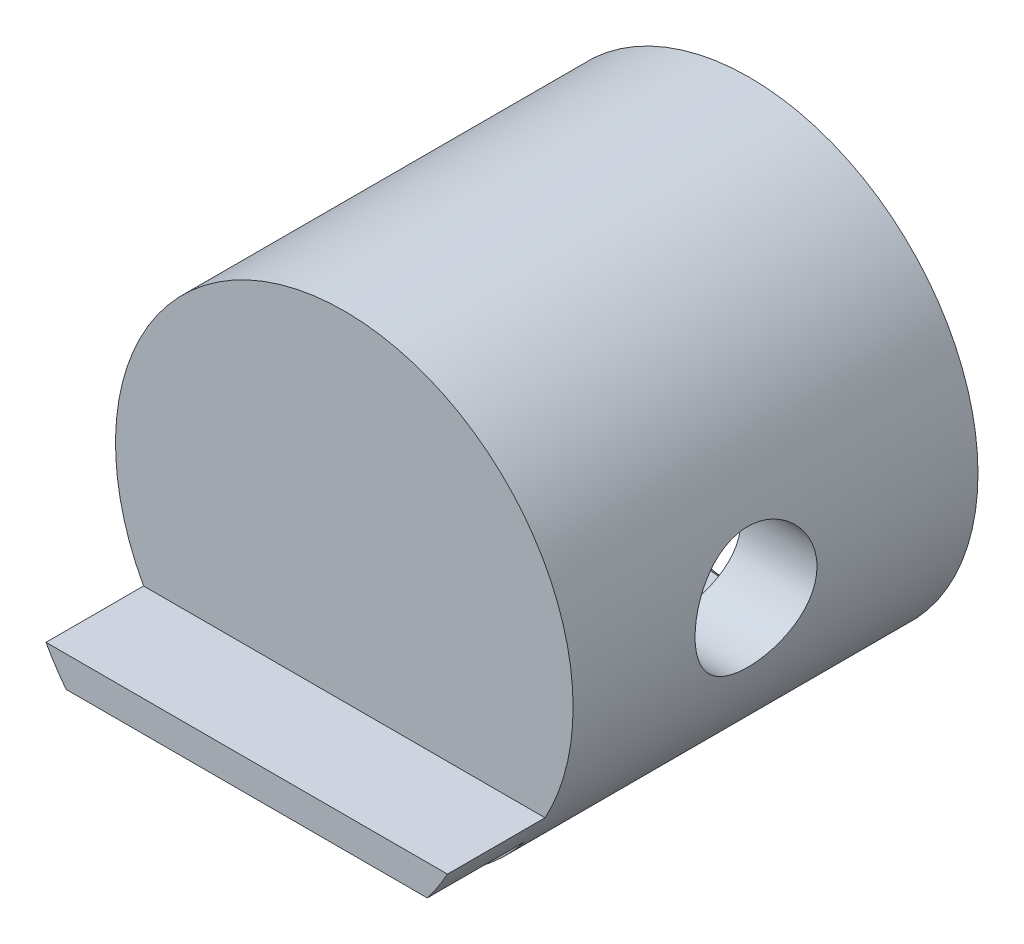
ISO-10303-21;
HEADER;
FILE_DESCRIPTION(('STEP AP214'),'2;1');
FILE_NAME('part.step','',(''),(''),'','','');
FILE_SCHEMA(('AUTOMOTIVE_DESIGN { 1 0 10303 214 1 1 1 1 }'));
ENDSEC;
DATA;
#1=APPLICATION_CONTEXT('core data for automotive mechanical design processes');
#2=APPLICATION_PROTOCOL_DEFINITION('international standard','automotive_design',2000,#1);
#3=PRODUCT_CONTEXT('',#1,'mechanical');
#4=PRODUCT('Part','Part','',(#3));
#5=PRODUCT_RELATED_PRODUCT_CATEGORY('part','',(#4));
#6=PRODUCT_DEFINITION_FORMATION('','',#4);
#7=PRODUCT_DEFINITION_CONTEXT('part definition',#1,'design');
#8=PRODUCT_DEFINITION('design','',#6,#7);
#9=PRODUCT_DEFINITION_SHAPE('','',#8);
#10=(LENGTH_UNIT() NAMED_UNIT(*) SI_UNIT(.MILLI.,.METRE.));
#11=(NAMED_UNIT(*) PLANE_ANGLE_UNIT() SI_UNIT($,.RADIAN.));
#12=(NAMED_UNIT(*) SI_UNIT($,.STERADIAN.) SOLID_ANGLE_UNIT());
#13=UNCERTAINTY_MEASURE_WITH_UNIT(LENGTH_MEASURE(1.E-05),#10,'distance_accuracy_value','');
#14=(GEOMETRIC_REPRESENTATION_CONTEXT(3) GLOBAL_UNCERTAINTY_ASSIGNED_CONTEXT((#13)) GLOBAL_UNIT_ASSIGNED_CONTEXT((#10,
#11,#12)) REPRESENTATION_CONTEXT('',''));
#15=CARTESIAN_POINT('',(0.,0.,0.));
#16=DIRECTION('',(0.,0.,1.));
#17=DIRECTION('',(1.,0.,0.));
#18=AXIS2_PLACEMENT_3D('',#15,#16,#17);
#19=CARTESIAN_POINT('',(0.,0.,26.0095999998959));
#20=DIRECTION('',(0.,0.,-1.));
#21=DIRECTION('',(-1.,0.,0.));
#22=AXIS2_PLACEMENT_3D('',#19,#20,#21);
#23=PLANE('',#22);
#24=CARTESIAN_POINT('',(0.,0.,26.0095999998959));
#25=DIRECTION('',(0.,0.,1.));
#26=DIRECTION('',(0.,1.,0.));
#27=AXIS2_PLACEMENT_3D('',#24,#25,#26);
#28=CIRCLE('',#27,12.1242666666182);
#29=CARTESIAN_POINT('',(0.,-12.1242666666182,26.0095999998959));
#30=VERTEX_POINT('',#29);
#31=CARTESIAN_POINT('',(0.,12.1242666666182,26.0095999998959));
#32=VERTEX_POINT('',#31);
#33=EDGE_CURVE('E241',#30,#32,#28,.F.);
#34=ORIENTED_EDGE('',*,*,#33,.T.);
#35=CARTESIAN_POINT('',(0.,0.,26.0095999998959));
#36=DIRECTION('',(0.,0.,1.));
#37=DIRECTION('',(0.,-1.,0.));
#38=AXIS2_PLACEMENT_3D('',#35,#36,#37);
#39=CIRCLE('',#38,12.1242666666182);
#40=EDGE_CURVE('E236',#32,#30,#39,.F.);
#41=ORIENTED_EDGE('',*,*,#40,.T.);
#42=EDGE_LOOP('',(#34,#41));
#43=FACE_BOUND('',#42,.T.);
#44=ADVANCED_FACE('F15',(#43),#23,.T.);
#45=CARTESIAN_POINT('',(0.,0.,23.909866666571));
#46=DIRECTION('',(0.,0.,-1.));
#47=DIRECTION('',(0.,-1.,0.));
#48=AXIS2_PLACEMENT_3D('',#45,#46,#47);
#49=TOROIDAL_SURFACE('',#48,12.1242666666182,2.09973333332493);
#50=ORIENTED_EDGE('',*,*,#33,.F.);
#51=ORIENTED_EDGE('',*,*,#40,.F.);
#52=EDGE_LOOP('',(#50,#51));
#53=FACE_BOUND('',#52,.T.);
#54=CARTESIAN_POINT('',(0.,0.,23.909866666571));
#55=DIRECTION('',(0.,0.,-1.));
#56=DIRECTION('',(-1.,0.,0.));
#57=AXIS2_PLACEMENT_3D('',#54,#55,#56);
#58=CIRCLE('',#57,14.2239999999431);
#59=CARTESIAN_POINT('',(-14.2239999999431,0.,23.909866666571));
#60=VERTEX_POINT('',#59);
#61=EDGE_CURVE('E245',#60,#60,#58,.T.);
#62=ORIENTED_EDGE('',*,*,#61,.T.);
#63=EDGE_LOOP('',(#62));
#64=FACE_BOUND('',#63,.T.);
#65=ADVANCED_FACE('F237',(#53,#64),#49,.F.);
#66=CARTESIAN_POINT('',(0.,0.,26.2737599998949));
#67=DIRECTION('',(0.,0.,-1.));
#68=DIRECTION('',(-1.,0.,0.));
#69=AXIS2_PLACEMENT_3D('',#66,#67,#68);
#70=CYLINDRICAL_SURFACE('',#69,14.2239999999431);
#71=ORIENTED_EDGE('',*,*,#61,.F.);
#72=EDGE_LOOP('',(#71));
#73=FACE_BOUND('',#72,.T.);
#74=CARTESIAN_POINT('',(0.,0.,22.826133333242));
#75=DIRECTION('',(0.,0.,-1.));
#76=DIRECTION('',(0.,-1.,0.));
#77=AXIS2_PLACEMENT_3D('',#74,#75,#76);
#78=CIRCLE('',#77,14.2239999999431);
#79=CARTESIAN_POINT('',(0.,-14.2239999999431,22.826133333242));
#80=VERTEX_POINT('',#79);
#81=EDGE_CURVE('E248',#80,#80,#78,.T.);
#82=ORIENTED_EDGE('',*,*,#81,.T.);
#83=EDGE_LOOP('',(#82));
#84=FACE_BOUND('',#83,.T.);
#85=ADVANCED_FACE('F260',(#73,#84),#70,.F.);
#86=CARTESIAN_POINT('',(0.,0.,4.67359999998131));
#87=DIRECTION('',(0.,0.,-1.));
#88=DIRECTION('',(0.,-1.,0.));
#89=AXIS2_PLACEMENT_3D('',#86,#87,#88);
#90=TOROIDAL_SURFACE('',#89,12.1242666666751,2.09973333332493);
#91=CARTESIAN_POINT('',(0.,0.,4.67359999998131));
#92=DIRECTION('',(0.,0.,-1.));
#93=DIRECTION('',(-1.,0.,0.));
#94=AXIS2_PLACEMENT_3D('',#91,#92,#93);
#95=CIRCLE('',#94,14.224);
#96=CARTESIAN_POINT('',(-14.224,0.,4.67359999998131));
#97=VERTEX_POINT('',#96);
#98=EDGE_CURVE('E252',#97,#97,#95,.T.);
#99=ORIENTED_EDGE('',*,*,#98,.T.);
#100=EDGE_LOOP('',(#99));
#101=FACE_BOUND('',#100,.T.);
#102=CARTESIAN_POINT('',(0.,0.,6.77333333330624));
#103=DIRECTION('',(0.,0.,1.));
#104=DIRECTION('',(0.,-1.,0.));
#105=AXIS2_PLACEMENT_3D('',#102,#103,#104);
#106=CIRCLE('',#105,12.1242666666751);
#107=CARTESIAN_POINT('',(0.,12.1242666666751,6.77333333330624));
#108=VERTEX_POINT('',#107);
#109=CARTESIAN_POINT('',(0.,-12.1242666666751,6.77333333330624));
#110=VERTEX_POINT('',#109);
#111=EDGE_CURVE('E179',#108,#110,#106,.F.);
#112=ORIENTED_EDGE('',*,*,#111,.F.);
#113=CARTESIAN_POINT('',(0.,0.,6.77333333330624));
#114=DIRECTION('',(0.,0.,1.));
#115=DIRECTION('',(0.,1.,0.));
#116=AXIS2_PLACEMENT_3D('',#113,#114,#115);
#117=CIRCLE('',#116,12.1242666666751);
#118=EDGE_CURVE('E167',#110,#108,#117,.F.);
#119=ORIENTED_EDGE('',*,*,#118,.F.);
#120=EDGE_LOOP('',(#112,#119));
#121=FACE_BOUND('',#120,.T.);
#122=ADVANCED_FACE('F203',(#101,#121),#90,.F.);
#123=CARTESIAN_POINT('',(0.,0.,22.826133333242));
#124=DIRECTION('',(0.,0.,-1.));
#125=DIRECTION('',(0.,-1.,0.));
#126=AXIS2_PLACEMENT_3D('',#123,#124,#125);
#127=TOROIDAL_SURFACE('',#126,12.1242666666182,2.09973333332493);
#128=ORIENTED_EDGE('',*,*,#81,.F.);
#129=EDGE_LOOP('',(#128));
#130=FACE_BOUND('',#129,.T.);
#131=CARTESIAN_POINT('',(0.,0.,20.7263999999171));
#132=DIRECTION('',(0.,0.,-1.));
#133=DIRECTION('',(0.,-1.,0.));
#134=AXIS2_PLACEMENT_3D('',#131,#132,#133);
#135=CIRCLE('',#134,12.1242666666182);
#136=CARTESIAN_POINT('',(0.,-12.1242666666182,20.7263999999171));
#137=VERTEX_POINT('',#136);
#138=CARTESIAN_POINT('',(0.,12.1242666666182,20.7263999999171));
#139=VERTEX_POINT('',#138);
#140=EDGE_CURVE('E192',#137,#139,#135,.T.);
#141=ORIENTED_EDGE('',*,*,#140,.T.);
#142=CARTESIAN_POINT('',(0.,0.,20.7263999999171));
#143=DIRECTION('',(0.,0.,-1.));
#144=DIRECTION('',(0.,1.,0.));
#145=AXIS2_PLACEMENT_3D('',#142,#143,#144);
#146=CIRCLE('',#145,12.1242666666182);
#147=EDGE_CURVE('E278',#139,#137,#146,.T.);
#148=ORIENTED_EDGE('',*,*,#147,.T.);
#149=EDGE_LOOP('',(#141,#148));
#150=FACE_BOUND('',#149,.T.);
#151=ADVANCED_FACE('F198',(#130,#150),#127,.F.);
#152=CARTESIAN_POINT('',(0.,0.,7.11199999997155));
#153=DIRECTION('',(0.,0.,-1.));
#154=DIRECTION('',(-1.,0.,0.));
#155=AXIS2_PLACEMENT_3D('',#152,#153,#154);
#156=CYLINDRICAL_SURFACE('',#155,14.224);
#157=ORIENTED_EDGE('',*,*,#98,.F.);
#158=EDGE_LOOP('',(#157));
#159=FACE_BOUND('',#158,.T.);
#160=CARTESIAN_POINT('',(0.,0.,1.01599999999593));
#161=DIRECTION('',(0.,0.,-1.));
#162=DIRECTION('',(0.,-1.,0.));
#163=AXIS2_PLACEMENT_3D('',#160,#161,#162);
#164=CIRCLE('',#163,14.224);
#165=CARTESIAN_POINT('',(0.,-14.224,1.01599999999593));
#166=VERTEX_POINT('',#165);
#167=EDGE_CURVE('E183',#166,#166,#164,.T.);
#168=ORIENTED_EDGE('',*,*,#167,.T.);
#169=EDGE_LOOP('',(#168));
#170=FACE_BOUND('',#169,.T.);
#171=ADVANCED_FACE('F202',(#159,#170),#156,.F.);
#172=CARTESIAN_POINT('',(0.,0.,6.77333333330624));
#173=DIRECTION('',(0.,0.,-1.));
#174=DIRECTION('',(-1.,0.,0.));
#175=AXIS2_PLACEMENT_3D('',#172,#173,#174);
#176=PLANE('',#175);
#177=CARTESIAN_POINT('',(0.,0.,6.77333333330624));
#178=DIRECTION('',(0.,0.,1.));
#179=DIRECTION('',(1.,0.,0.));
#180=AXIS2_PLACEMENT_3D('',#177,#178,#179);
#181=CIRCLE('',#180,10.5791);
#182=CARTESIAN_POINT('',(10.5791,0.,6.77333333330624));
#183=VERTEX_POINT('',#182);
#184=EDGE_CURVE('E191',#183,#183,#181,.T.);
#185=ORIENTED_EDGE('',*,*,#184,.T.);
#186=EDGE_LOOP('',(#185));
#187=FACE_BOUND('',#186,.T.);
#188=ORIENTED_EDGE('',*,*,#118,.T.);
#189=ORIENTED_EDGE('',*,*,#111,.T.);
#190=EDGE_LOOP('',(#188,#189));
#191=FACE_BOUND('',#190,.T.);
#192=ADVANCED_FACE('F141',(#187,#191),#176,.T.);
#193=CARTESIAN_POINT('',(0.,0.,20.7263999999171));
#194=DIRECTION('',(0.,0.,-1.));
#195=DIRECTION('',(-1.,0.,0.));
#196=AXIS2_PLACEMENT_3D('',#193,#194,#195);
#197=PLANE('',#196);
#198=CARTESIAN_POINT('',(0.,0.,20.7263999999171));
#199=DIRECTION('',(0.,0.,1.));
#200=DIRECTION('',(1.,0.,0.));
#201=AXIS2_PLACEMENT_3D('',#198,#199,#200);
#202=CIRCLE('',#201,10.5791);
#203=CARTESIAN_POINT('',(10.5791,0.,20.7263999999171));
#204=VERTEX_POINT('',#203);
#205=EDGE_CURVE('E330',#204,#204,#202,.F.);
#206=ORIENTED_EDGE('',*,*,#205,.T.);
#207=EDGE_LOOP('',(#206));
#208=FACE_BOUND('',#207,.T.);
#209=ORIENTED_EDGE('',*,*,#147,.F.);
#210=ORIENTED_EDGE('',*,*,#140,.F.);
#211=EDGE_LOOP('',(#209,#210));
#212=FACE_BOUND('',#211,.T.);
#213=ADVANCED_FACE('F136',(#208,#212),#197,.F.);
#214=CARTESIAN_POINT('',(0.,0.,0.));
#215=DIRECTION('',(0.,0.,-1.));
#216=DIRECTION('',(-1.,0.,0.));
#217=AXIS2_PLACEMENT_3D('',#214,#215,#216);
#218=CONICAL_SURFACE('',#217,15.2399999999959,0.785398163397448);
#219=ORIENTED_EDGE('',*,*,#167,.F.);
#220=EDGE_LOOP('',(#219));
#221=FACE_BOUND('',#220,.T.);
#222=CARTESIAN_POINT('',(0.,0.,0.));
#223=DIRECTION('',(0.,0.,-1.));
#224=DIRECTION('',(-1.,0.,0.));
#225=AXIS2_PLACEMENT_3D('',#222,#223,#224);
#226=CIRCLE('',#225,15.2399999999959);
#227=CARTESIAN_POINT('',(-15.2399999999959,0.,0.));
#228=VERTEX_POINT('',#227);
#229=EDGE_CURVE('E328',#228,#228,#226,.T.);
#230=ORIENTED_EDGE('',*,*,#229,.T.);
#231=EDGE_LOOP('',(#230));
#232=FACE_BOUND('',#231,.T.);
#233=ADVANCED_FACE('F131',(#221,#232),#218,.F.);
#234=CARTESIAN_POINT('',(0.,0.,0.));
#235=DIRECTION('',(0.,0.,1.));
#236=DIRECTION('',(1.,0.,0.));
#237=AXIS2_PLACEMENT_3D('',#234,#235,#236);
#238=CYLINDRICAL_SURFACE('',#237,10.5791);
#239=CARTESIAN_POINT('',(9.69516609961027,4.2333333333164,15.4093333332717));
#240=CARTESIAN_POINT('',(9.69516265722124,4.23333665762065,15.5229202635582));
#241=CARTESIAN_POINT('',(9.69716654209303,4.2287595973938,15.6364735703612));
#242=CARTESIAN_POINT('',(9.70510465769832,4.2105116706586,15.8627406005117));
#243=CARTESIAN_POINT('',(9.71103949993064,4.19683938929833,15.975454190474));
#244=CARTESIAN_POINT('',(9.7266496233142,4.16053273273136,16.1992270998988));
#245=CARTESIAN_POINT('',(9.73632692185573,4.13789352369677,16.3102854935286));
#246=CARTESIAN_POINT('',(9.75909813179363,4.08389637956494,16.5299190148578));
#247=CARTESIAN_POINT('',(9.7721933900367,4.05253500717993,16.6384931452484));
#248=CARTESIAN_POINT('',(9.81591140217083,3.94603371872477,16.9586190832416));
#249=CARTESIAN_POINT('',(9.8510381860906,3.8583198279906,17.1655251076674));
#250=CARTESIAN_POINT('',(9.92928354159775,3.6522260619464,17.5616124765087));
#251=CARTESIAN_POINT('',(9.97240343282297,3.53384112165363,17.7507908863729));
#252=CARTESIAN_POINT('',(10.0645211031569,3.26256481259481,18.1169788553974));
#253=CARTESIAN_POINT('',(10.1137074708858,3.10820657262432,18.2928546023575));
#254=CARTESIAN_POINT('',(10.2108838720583,2.77230479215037,18.6171198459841));
#255=CARTESIAN_POINT('',(10.2588734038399,2.59075006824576,18.7654979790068));
#256=CARTESIAN_POINT('',(10.3271348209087,2.29746081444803,18.9670943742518));
#257=CARTESIAN_POINT('',(10.3496641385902,2.19398726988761,19.0318281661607));
#258=CARTESIAN_POINT('',(10.3924382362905,1.98149070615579,19.152286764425));
#259=CARTESIAN_POINT('',(10.4126839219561,1.87246991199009,19.2080151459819));
#260=CARTESIAN_POINT('',(10.4502936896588,1.64968744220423,19.3099275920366));
#261=CARTESIAN_POINT('',(10.4676601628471,1.53592979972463,19.3561195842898));
#262=CARTESIAN_POINT('',(10.4990188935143,1.30445689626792,19.4385515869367));
#263=CARTESIAN_POINT('',(10.5130120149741,1.18674265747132,19.4747941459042));
#264=CARTESIAN_POINT('',(10.5426969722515,0.893994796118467,19.5510699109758));
#265=CARTESIAN_POINT('',(10.55627454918,0.717206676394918,19.5853505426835));
#266=CARTESIAN_POINT('',(10.5744734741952,0.36025108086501,19.6311449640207));
#267=CARTESIAN_POINT('',(10.5790959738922,0.180084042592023,19.6426616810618));
#268=CARTESIAN_POINT('',(10.5791025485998,-0.113996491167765,19.6426698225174));
#269=CARTESIAN_POINT('',(10.5772544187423,-0.227959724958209,19.6380600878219));
#270=CARTESIAN_POINT('',(10.5699182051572,-0.455060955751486,19.6196780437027));
#271=CARTESIAN_POINT('',(10.564429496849,-0.568198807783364,19.6059041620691));
#272=CARTESIAN_POINT('',(10.5499501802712,-0.792829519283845,19.5693195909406));
#273=CARTESIAN_POINT('',(10.5409579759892,-0.904321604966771,19.5465047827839));
#274=CARTESIAN_POINT('',(10.5197152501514,-1.12483352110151,19.492075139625));
#275=CARTESIAN_POINT('',(10.5074634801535,-1.23385238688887,19.4604569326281));
#276=CARTESIAN_POINT('',(10.4663466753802,-1.55543132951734,19.3530139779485));
#277=CARTESIAN_POINT('',(10.4330638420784,-1.76333436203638,19.2644652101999));
#278=CARTESIAN_POINT('',(10.3579901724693,-2.16114015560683,19.0563974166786));
#279=CARTESIAN_POINT('',(10.3161983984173,-2.35104092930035,18.9368749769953));
#280=CARTESIAN_POINT('',(10.2261509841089,-2.71663804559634,18.6643549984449));
#281=CARTESIAN_POINT('',(10.1776955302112,-2.89138156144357,18.5101459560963));
#282=CARTESIAN_POINT('',(10.0806628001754,-3.2133989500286,18.1750443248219));
#283=CARTESIAN_POINT('',(10.0320854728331,-3.36065811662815,17.994137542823));
#284=CARTESIAN_POINT('',(9.96200410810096,-3.56106166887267,17.7016703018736));
#285=CARTESIAN_POINT('',(9.93863728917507,-3.62559685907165,17.5981847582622));
#286=CARTESIAN_POINT('',(9.89401280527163,-3.74565930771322,17.3856982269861));
#287=CARTESIAN_POINT('',(9.87275430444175,-3.80119014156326,17.2766994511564));
#288=CARTESIAN_POINT('',(9.83306158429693,-3.9027210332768,17.0539747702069));
#289=CARTESIAN_POINT('',(9.81462481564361,-3.94872970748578,16.9402532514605));
#290=CARTESIAN_POINT('',(9.78119780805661,-4.03081683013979,16.708834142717));
#291=CARTESIAN_POINT('',(9.7662066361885,-4.06689796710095,16.5911376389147));
#292=CARTESIAN_POINT('',(9.73441322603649,-4.14257855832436,16.2992321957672));
#293=CARTESIAN_POINT('',(9.71979738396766,-4.17653994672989,16.1232814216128));
#294=CARTESIAN_POINT('',(9.70017739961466,-4.22191268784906,15.7679698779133));
#295=CARTESIAN_POINT('',(9.69517153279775,-4.23332808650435,15.5886097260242));
#296=CARTESIAN_POINT('',(9.69516265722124,-4.23333665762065,15.2957464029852));
#297=CARTESIAN_POINT('',(9.69716654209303,-4.2287595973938,15.1821930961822));
#298=CARTESIAN_POINT('',(9.70510465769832,-4.2105116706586,14.9559260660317));
#299=CARTESIAN_POINT('',(9.71103949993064,-4.19683938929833,14.8432124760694));
#300=CARTESIAN_POINT('',(9.7266496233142,-4.16053273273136,14.6194395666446));
#301=CARTESIAN_POINT('',(9.73632692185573,-4.13789352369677,14.5083811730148));
#302=CARTESIAN_POINT('',(9.75909813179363,-4.08389637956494,14.2887476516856));
#303=CARTESIAN_POINT('',(9.7721933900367,-4.05253500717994,14.180173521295));
#304=CARTESIAN_POINT('',(9.81591140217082,-3.94603371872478,13.8600475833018));
#305=CARTESIAN_POINT('',(9.85103818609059,-3.8583198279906,13.653141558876));
#306=CARTESIAN_POINT('',(9.92928354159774,-3.65222606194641,13.2570541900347));
#307=CARTESIAN_POINT('',(9.97240343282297,-3.53384112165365,13.0678757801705));
#308=CARTESIAN_POINT('',(10.0645211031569,-3.26256481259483,12.701687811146));
#309=CARTESIAN_POINT('',(10.1137074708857,-3.10820657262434,12.5258120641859));
#310=CARTESIAN_POINT('',(10.2108838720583,-2.77230479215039,12.2015468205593));
#311=CARTESIAN_POINT('',(10.2588734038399,-2.59075006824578,12.0531686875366));
#312=CARTESIAN_POINT('',(10.3271348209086,-2.29746081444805,11.8515722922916));
#313=CARTESIAN_POINT('',(10.3496641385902,-2.19398726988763,11.7868385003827));
#314=CARTESIAN_POINT('',(10.3924382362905,-1.98149070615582,11.6663799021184));
#315=CARTESIAN_POINT('',(10.4126839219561,-1.87246991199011,11.6106515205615));
#316=CARTESIAN_POINT('',(10.4502936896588,-1.64968744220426,11.5087390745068));
#317=CARTESIAN_POINT('',(10.4676601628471,-1.53592979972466,11.4625470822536));
#318=CARTESIAN_POINT('',(10.4990188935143,-1.30445689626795,11.3801150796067));
#319=CARTESIAN_POINT('',(10.5130120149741,-1.18674265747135,11.3438725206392));
#320=CARTESIAN_POINT('',(10.5426969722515,-0.893994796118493,11.2675967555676));
#321=CARTESIAN_POINT('',(10.55627454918,-0.717206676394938,11.2333161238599));
#322=CARTESIAN_POINT('',(10.5744734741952,-0.360251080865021,11.1875217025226));
#323=CARTESIAN_POINT('',(10.5790959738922,-0.18008404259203,11.1760049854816));
#324=CARTESIAN_POINT('',(10.5791025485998,0.113996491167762,11.175996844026));
#325=CARTESIAN_POINT('',(10.5772544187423,0.227959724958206,11.1806065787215));
#326=CARTESIAN_POINT('',(10.5699182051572,0.455060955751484,11.1989886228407));
#327=CARTESIAN_POINT('',(10.564429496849,0.568198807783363,11.2127625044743));
#328=CARTESIAN_POINT('',(10.5499501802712,0.792829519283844,11.2493470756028));
#329=CARTESIAN_POINT('',(10.5409579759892,0.90432160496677,11.2721618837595));
#330=CARTESIAN_POINT('',(10.5197152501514,1.12483352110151,11.3265915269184));
#331=CARTESIAN_POINT('',(10.5074634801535,1.23385238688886,11.3582097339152));
#332=CARTESIAN_POINT('',(10.4663466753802,1.55543132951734,11.4656526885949));
#333=CARTESIAN_POINT('',(10.4330638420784,1.76333436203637,11.5542014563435));
#334=CARTESIAN_POINT('',(10.3579901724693,2.16114015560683,11.7622692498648));
#335=CARTESIAN_POINT('',(10.3161983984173,2.35104092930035,11.8817916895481));
#336=CARTESIAN_POINT('',(10.2261509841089,2.71663804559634,12.1543116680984));
#337=CARTESIAN_POINT('',(10.1776955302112,2.89138156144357,12.3085207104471));
#338=CARTESIAN_POINT('',(10.0806628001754,3.2133989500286,12.6436223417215));
#339=CARTESIAN_POINT('',(10.032085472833,3.36065811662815,12.8245291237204));
#340=CARTESIAN_POINT('',(9.96200410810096,3.56106166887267,13.1169963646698));
#341=CARTESIAN_POINT('',(9.93863728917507,3.62559685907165,13.2204819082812));
#342=CARTESIAN_POINT('',(9.89401280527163,3.74565930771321,13.4329684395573));
#343=CARTESIAN_POINT('',(9.87275430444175,3.80119014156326,13.541967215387));
#344=CARTESIAN_POINT('',(9.83306158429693,3.9027210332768,13.7646918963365));
#345=CARTESIAN_POINT('',(9.81462481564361,3.94872970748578,13.8784134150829));
#346=CARTESIAN_POINT('',(9.78119780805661,4.03081683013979,14.1098325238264));
#347=CARTESIAN_POINT('',(9.7662066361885,4.06689796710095,14.2275290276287));
#348=CARTESIAN_POINT('',(9.73441322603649,4.14257855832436,14.5194344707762));
#349=CARTESIAN_POINT('',(9.71979738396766,4.17653994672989,14.6953852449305));
#350=CARTESIAN_POINT('',(9.70017739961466,4.22191268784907,15.0506967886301));
#351=CARTESIAN_POINT('',(9.69517153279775,4.23332808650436,15.2300569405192));
#352=CARTESIAN_POINT('',(9.69516609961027,4.2333333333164,15.4093333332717));
#353=B_SPLINE_CURVE_WITH_KNOTS('',3,(#239,#240,#241,#242,#243,#244,#245,#246,#247,#248,#249,
#250,#251,#252,#253,#254,#255,#256,#257,#258,#259,#260,#261,#262,#263,#264,#265,#266,#267,#268,
#269,#270,#271,#272,#273,#274,#275,#276,#277,#278,#279,#280,#281,#282,#283,#284,#285,#286,#287,
#288,#289,#290,#291,#292,#293,#294,#295,#296,#297,#298,#299,#300,#301,#302,#303,#304,#305,#306,
#307,#308,#309,#310,#311,#312,#313,#314,#315,#316,#317,#318,#319,#320,#321,#322,#323,#324,#325,
#326,#327,#328,#329,#330,#331,#332,#333,#334,#335,#336,#337,#338,#339,#340,#341,#342,#343,#344,
#345,#346,#347,#348,#349,#350,#351,#352),.UNSPECIFIED.,.T.,.F.,(4,2,2,2,2,2,2,2,2,2,2,2,2,2,2,2,
2,2,2,2,2,2,2,2,2,2,2,2,2,2,2,2,2,2,2,2,2,2,2,2,2,2,2,2,2,2,2,2,2,2,2,2,2,2,2,2,4),(0.,
0.340592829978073,0.68123865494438,1.02206836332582,1.36303257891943,2.04209904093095,
2.72127771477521,3.43554914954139,4.15011510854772,4.52206957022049,4.89387599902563,
5.26537208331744,5.63677291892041,6.17683254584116,6.71682271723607,7.05864636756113,
7.4005286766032,7.74256691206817,8.08473634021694,8.76660585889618,9.44855056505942,
10.1596155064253,10.8710598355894,11.2432033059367,11.6151986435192,11.9868558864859,
12.3584123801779,12.8960729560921,13.4336370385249,13.774229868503,14.1148756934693,
14.4557054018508,14.7966696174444,15.4757360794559,16.1549147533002,16.8691861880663,
17.5837521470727,17.9557066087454,18.3275130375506,18.6990091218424,19.0704099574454,
19.6104695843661,20.150459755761,20.4922834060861,20.8341657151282,21.1762039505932,
21.5183733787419,22.2002428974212,22.8821876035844,23.5932525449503,24.3046968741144,
24.6768403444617,25.0488356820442,25.4204929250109,25.7920494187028,26.3297099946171,
26.8672740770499),.UNSPECIFIED.);
#354=CARTESIAN_POINT('',(9.69516609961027,4.2333333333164,15.4093333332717));
#355=VERTEX_POINT('',#354);
#356=EDGE_CURVE('E122',#355,#355,#353,.T.);
#357=ORIENTED_EDGE('',*,*,#356,.T.);
#358=EDGE_LOOP('',(#357));
#359=FACE_BOUND('',#358,.T.);
#360=ORIENTED_EDGE('',*,*,#205,.F.);
#361=EDGE_LOOP('',(#360));
#362=FACE_BOUND('',#361,.T.);
#363=CARTESIAN_POINT('',(-10.5791,0.,11.1759999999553));
#364=CARTESIAN_POINT('',(-10.5791025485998,-0.113996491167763,11.175996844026));
#365=CARTESIAN_POINT('',(-10.5772544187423,-0.227959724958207,11.1806065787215));
#366=CARTESIAN_POINT('',(-10.5699182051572,-0.455060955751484,11.1989886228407));
#367=CARTESIAN_POINT('',(-10.564429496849,-0.568198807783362,11.2127625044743));
#368=CARTESIAN_POINT('',(-10.5499501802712,-0.792829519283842,11.2493470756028));
#369=CARTESIAN_POINT('',(-10.5409579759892,-0.904321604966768,11.2721618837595));
#370=CARTESIAN_POINT('',(-10.5197152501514,-1.12483352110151,11.3265915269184));
#371=CARTESIAN_POINT('',(-10.5074634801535,-1.23385238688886,11.3582097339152));
#372=CARTESIAN_POINT('',(-10.4663466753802,-1.55543132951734,11.4656526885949));
#373=CARTESIAN_POINT('',(-10.4330638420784,-1.76333436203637,11.5542014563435));
#374=CARTESIAN_POINT('',(-10.3579901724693,-2.16114015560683,11.7622692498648));
#375=CARTESIAN_POINT('',(-10.3161983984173,-2.35104092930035,11.8817916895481));
#376=CARTESIAN_POINT('',(-10.2261509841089,-2.71663804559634,12.1543116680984));
#377=CARTESIAN_POINT('',(-10.1776955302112,-2.89138156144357,12.3085207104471));
#378=CARTESIAN_POINT('',(-10.0806628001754,-3.2133989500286,12.6436223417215));
#379=CARTESIAN_POINT('',(-10.032085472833,-3.36065811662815,12.8245291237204));
#380=CARTESIAN_POINT('',(-9.96200410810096,-3.56106166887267,13.1169963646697));
#381=CARTESIAN_POINT('',(-9.93863728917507,-3.62559685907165,13.2204819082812));
#382=CARTESIAN_POINT('',(-9.89401280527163,-3.74565930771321,13.4329684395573));
#383=CARTESIAN_POINT('',(-9.87275430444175,-3.80119014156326,13.541967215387));
#384=CARTESIAN_POINT('',(-9.83306158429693,-3.9027210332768,13.7646918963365));
#385=CARTESIAN_POINT('',(-9.81462481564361,-3.94872970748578,13.8784134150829));
#386=CARTESIAN_POINT('',(-9.78119780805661,-4.03081683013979,14.1098325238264));
#387=CARTESIAN_POINT('',(-9.7662066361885,-4.06689796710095,14.2275290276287));
#388=CARTESIAN_POINT('',(-9.73441322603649,-4.14257855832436,14.5194344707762));
#389=CARTESIAN_POINT('',(-9.71979738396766,-4.17653994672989,14.6953852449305));
#390=CARTESIAN_POINT('',(-9.70017739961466,-4.22191268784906,15.0506967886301));
#391=CARTESIAN_POINT('',(-9.69517153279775,-4.23332808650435,15.2300569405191));
#392=CARTESIAN_POINT('',(-9.69516265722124,-4.23333665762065,15.5229202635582));
#393=CARTESIAN_POINT('',(-9.69716654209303,-4.2287595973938,15.6364735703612));
#394=CARTESIAN_POINT('',(-9.70510465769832,-4.2105116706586,15.8627406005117));
#395=CARTESIAN_POINT('',(-9.71103949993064,-4.19683938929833,15.975454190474));
#396=CARTESIAN_POINT('',(-9.7266496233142,-4.16053273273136,16.1992270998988));
#397=CARTESIAN_POINT('',(-9.73632692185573,-4.13789352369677,16.3102854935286));
#398=CARTESIAN_POINT('',(-9.75909813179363,-4.08389637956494,16.5299190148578));
#399=CARTESIAN_POINT('',(-9.7721933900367,-4.05253500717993,16.6384931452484));
#400=CARTESIAN_POINT('',(-9.81591140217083,-3.94603371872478,16.9586190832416));
#401=CARTESIAN_POINT('',(-9.8510381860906,-3.8583198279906,17.1655251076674));
#402=CARTESIAN_POINT('',(-9.92928354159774,-3.6522260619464,17.5616124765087));
#403=CARTESIAN_POINT('',(-9.97240343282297,-3.53384112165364,17.7507908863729));
#404=CARTESIAN_POINT('',(-10.0645211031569,-3.26256481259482,18.1169788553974));
#405=CARTESIAN_POINT('',(-10.1137074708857,-3.10820657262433,18.2928546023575));
#406=CARTESIAN_POINT('',(-10.2108838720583,-2.77230479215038,18.6171198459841));
#407=CARTESIAN_POINT('',(-10.2588734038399,-2.59075006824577,18.7654979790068));
#408=CARTESIAN_POINT('',(-10.3271348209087,-2.29746081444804,18.9670943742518));
#409=CARTESIAN_POINT('',(-10.3496641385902,-2.19398726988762,19.0318281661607));
#410=CARTESIAN_POINT('',(-10.3924382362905,-1.98149070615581,19.152286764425));
#411=CARTESIAN_POINT('',(-10.4126839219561,-1.8724699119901,19.2080151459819));
#412=CARTESIAN_POINT('',(-10.4502936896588,-1.64968744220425,19.3099275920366));
#413=CARTESIAN_POINT('',(-10.4676601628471,-1.53592979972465,19.3561195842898));
#414=CARTESIAN_POINT('',(-10.4990188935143,-1.30445689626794,19.4385515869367));
#415=CARTESIAN_POINT('',(-10.5130120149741,-1.18674265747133,19.4747941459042));
#416=CARTESIAN_POINT('',(-10.5426969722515,-0.893994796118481,19.5510699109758));
#417=CARTESIAN_POINT('',(-10.55627454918,-0.717206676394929,19.5853505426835));
#418=CARTESIAN_POINT('',(-10.5744734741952,-0.360251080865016,19.6311449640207));
#419=CARTESIAN_POINT('',(-10.5790959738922,-0.180084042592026,19.6426616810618));
#420=CARTESIAN_POINT('',(-10.5791025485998,0.113996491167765,19.6426698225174));
#421=CARTESIAN_POINT('',(-10.5772544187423,0.227959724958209,19.6380600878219));
#422=CARTESIAN_POINT('',(-10.5699182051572,0.455060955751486,19.6196780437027));
#423=CARTESIAN_POINT('',(-10.564429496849,0.568198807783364,19.6059041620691));
#424=CARTESIAN_POINT('',(-10.5499501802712,0.792829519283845,19.5693195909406));
#425=CARTESIAN_POINT('',(-10.5409579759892,0.904321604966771,19.5465047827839));
#426=CARTESIAN_POINT('',(-10.5197152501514,1.12483352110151,19.492075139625));
#427=CARTESIAN_POINT('',(-10.5074634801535,1.23385238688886,19.4604569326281));
#428=CARTESIAN_POINT('',(-10.4663466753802,1.55543132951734,19.3530139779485));
#429=CARTESIAN_POINT('',(-10.4330638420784,1.76333436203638,19.2644652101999));
#430=CARTESIAN_POINT('',(-10.3579901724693,2.16114015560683,19.0563974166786));
#431=CARTESIAN_POINT('',(-10.3161983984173,2.35104092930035,18.9368749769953));
#432=CARTESIAN_POINT('',(-10.2261509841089,2.71663804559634,18.6643549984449));
#433=CARTESIAN_POINT('',(-10.1776955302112,2.89138156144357,18.5101459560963));
#434=CARTESIAN_POINT('',(-10.0806628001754,3.2133989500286,18.1750443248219));
#435=CARTESIAN_POINT('',(-10.032085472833,3.36065811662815,17.994137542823));
#436=CARTESIAN_POINT('',(-9.96200410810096,3.56106166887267,17.7016703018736));
#437=CARTESIAN_POINT('',(-9.93863728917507,3.62559685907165,17.5981847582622));
#438=CARTESIAN_POINT('',(-9.89401280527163,3.74565930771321,17.3856982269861));
#439=CARTESIAN_POINT('',(-9.87275430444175,3.80119014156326,17.2766994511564));
#440=CARTESIAN_POINT('',(-9.83306158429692,3.9027210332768,17.0539747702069));
#441=CARTESIAN_POINT('',(-9.81462481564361,3.94872970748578,16.9402532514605));
#442=CARTESIAN_POINT('',(-9.78119780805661,4.03081683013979,16.708834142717));
#443=CARTESIAN_POINT('',(-9.7662066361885,4.06689796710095,16.5911376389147));
#444=CARTESIAN_POINT('',(-9.73441322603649,4.14257855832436,16.2992321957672));
#445=CARTESIAN_POINT('',(-9.71979738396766,4.17653994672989,16.1232814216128));
#446=CARTESIAN_POINT('',(-9.70017739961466,4.22191268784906,15.7679698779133));
#447=CARTESIAN_POINT('',(-9.69517153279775,4.23332808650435,15.5886097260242));
#448=CARTESIAN_POINT('',(-9.69516265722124,4.23333665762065,15.2957464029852));
#449=CARTESIAN_POINT('',(-9.69716654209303,4.2287595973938,15.1821930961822));
#450=CARTESIAN_POINT('',(-9.70510465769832,4.2105116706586,14.9559260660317));
#451=CARTESIAN_POINT('',(-9.71103949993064,4.19683938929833,14.8432124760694));
#452=CARTESIAN_POINT('',(-9.7266496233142,4.16053273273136,14.6194395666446));
#453=CARTESIAN_POINT('',(-9.73632692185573,4.13789352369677,14.5083811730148));
#454=CARTESIAN_POINT('',(-9.75909813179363,4.08389637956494,14.2887476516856));
#455=CARTESIAN_POINT('',(-9.7721933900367,4.05253500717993,14.180173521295));
#456=CARTESIAN_POINT('',(-9.81591140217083,3.94603371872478,13.8600475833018));
#457=CARTESIAN_POINT('',(-9.8510381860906,3.8583198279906,13.653141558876));
#458=CARTESIAN_POINT('',(-9.92928354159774,3.65222606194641,13.2570541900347));
#459=CARTESIAN_POINT('',(-9.97240343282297,3.53384112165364,13.0678757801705));
#460=CARTESIAN_POINT('',(-10.0645211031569,3.26256481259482,12.701687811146));
#461=CARTESIAN_POINT('',(-10.1137074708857,3.10820657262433,12.5258120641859));
#462=CARTESIAN_POINT('',(-10.2108838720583,2.77230479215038,12.2015468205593));
#463=CARTESIAN_POINT('',(-10.2588734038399,2.59075006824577,12.0531686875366));
#464=CARTESIAN_POINT('',(-10.3271348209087,2.29746081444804,11.8515722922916));
#465=CARTESIAN_POINT('',(-10.3496641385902,2.19398726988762,11.7868385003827));
#466=CARTESIAN_POINT('',(-10.3924382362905,1.98149070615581,11.6663799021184));
#467=CARTESIAN_POINT('',(-10.4126839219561,1.8724699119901,11.6106515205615));
#468=CARTESIAN_POINT('',(-10.4502936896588,1.64968744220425,11.5087390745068));
#469=CARTESIAN_POINT('',(-10.4676601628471,1.53592979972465,11.4625470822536));
#470=CARTESIAN_POINT('',(-10.4990188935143,1.30445689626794,11.3801150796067));
#471=CARTESIAN_POINT('',(-10.5130120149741,1.18674265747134,11.3438725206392));
#472=CARTESIAN_POINT('',(-10.5426969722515,0.893994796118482,11.2675967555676));
#473=CARTESIAN_POINT('',(-10.55627454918,0.71720667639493,11.2333161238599));
#474=CARTESIAN_POINT('',(-10.5744734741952,0.360251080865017,11.1875217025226));
#475=CARTESIAN_POINT('',(-10.5790959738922,0.180084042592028,11.1760049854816));
#476=CARTESIAN_POINT('',(-10.5791,0.,11.1759999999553));
#477=B_SPLINE_CURVE_WITH_KNOTS('',3,(#363,#364,#365,#366,#367,#368,#369,#370,#371,#372,#373,
#374,#375,#376,#377,#378,#379,#380,#381,#382,#383,#384,#385,#386,#387,#388,#389,#390,#391,#392,
#393,#394,#395,#396,#397,#398,#399,#400,#401,#402,#403,#404,#405,#406,#407,#408,#409,#410,#411,
#412,#413,#414,#415,#416,#417,#418,#419,#420,#421,#422,#423,#424,#425,#426,#427,#428,#429,#430,
#431,#432,#433,#434,#435,#436,#437,#438,#439,#440,#441,#442,#443,#444,#445,#446,#447,#448,#449,
#450,#451,#452,#453,#454,#455,#456,#457,#458,#459,#460,#461,#462,#463,#464,#465,#466,#467,#468,
#469,#470,#471,#472,#473,#474,#475,#476),.UNSPECIFIED.,.T.,.F.,(4,2,2,2,2,2,2,2,2,2,2,2,2,2,2,2,
2,2,2,2,2,2,2,2,2,2,2,2,2,2,2,2,2,2,2,2,2,2,2,2,2,2,2,2,2,2,2,2,2,2,2,2,2,2,2,2,4),(0.,
0.341823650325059,0.68370595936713,1.0257441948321,1.36791362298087,2.04978314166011,
2.73172784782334,3.44279278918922,4.15423711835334,4.52638058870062,4.8983759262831,
5.27003316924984,5.64158966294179,6.17925023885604,6.71681432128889,7.05740715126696,
7.39805297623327,7.73888268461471,8.07984690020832,8.75891336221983,9.43809203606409,
10.1523634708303,10.8669294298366,11.2388838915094,11.6106903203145,11.9821864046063,
12.3535872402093,12.8936468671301,13.433637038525,13.77546068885,14.1173429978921,
14.4593812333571,14.8015506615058,15.4834201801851,16.1653648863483,16.8764298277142,
17.5878741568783,17.9600176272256,18.3320129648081,18.7036702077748,19.0752267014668,
19.612887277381,20.1504513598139,20.4910441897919,20.8316900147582,21.1725197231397,
21.5134839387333,22.1925504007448,22.8717290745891,23.5860005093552,24.3005664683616,
24.6725209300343,25.0443273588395,25.4158234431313,25.7872242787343,26.327283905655,
26.8672740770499),.UNSPECIFIED.);
#478=CARTESIAN_POINT('',(-10.5791,0.,11.1759999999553));
#479=VERTEX_POINT('',#478);
#480=EDGE_CURVE('E115',#479,#479,#477,.T.);
#481=ORIENTED_EDGE('',*,*,#480,.T.);
#482=EDGE_LOOP('',(#481));
#483=FACE_BOUND('',#482,.T.);
#484=ORIENTED_EDGE('',*,*,#184,.F.);
#485=EDGE_LOOP('',(#484));
#486=FACE_BOUND('',#485,.T.);
#487=ADVANCED_FACE('F126',(#359,#362,#483,#486),#238,.F.);
#488=CARTESIAN_POINT('',(0.,0.,0.));
#489=DIRECTION('',(0.,0.,1.));
#490=DIRECTION('',(1.,0.,0.));
#491=AXIS2_PLACEMENT_3D('',#488,#489,#490);
#492=PLANE('',#491);
#493=ORIENTED_EDGE('',*,*,#229,.F.);
#494=EDGE_LOOP('',(#493));
#495=FACE_BOUND('',#494,.T.);
#496=CARTESIAN_POINT('',(0.,0.,0.));
#497=DIRECTION('',(0.,0.,1.));
#498=DIRECTION('',(1.,0.,0.));
#499=AXIS2_PLACEMENT_3D('',#496,#497,#498);
#500=CIRCLE('',#499,15.88262);
#501=CARTESIAN_POINT('',(15.88262,0.,0.));
#502=VERTEX_POINT('',#501);
#503=EDGE_CURVE('E96',#502,#502,#500,.T.);
#504=ORIENTED_EDGE('',*,*,#503,.F.);
#505=EDGE_LOOP('',(#504));
#506=FACE_BOUND('',#505,.T.);
#507=ADVANCED_FACE('F130',(#495,#506),#492,.F.);
#508=CARTESIAN_POINT('',(-19.059144,0.,15.4093333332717));
#509=DIRECTION('',(1.,0.,0.));
#510=DIRECTION('',(0.,0.,-1.));
#511=AXIS2_PLACEMENT_3D('',#508,#509,#510);
#512=CYLINDRICAL_SURFACE('',#511,4.2333333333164);
#513=CARTESIAN_POINT('',(15.88262,0.,11.1759999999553));
#514=CARTESIAN_POINT('',(15.8826137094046,-0.233279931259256,11.1760100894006));
#515=CARTESIAN_POINT('',(15.8774273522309,-0.466690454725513,11.1953551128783));
#516=CARTESIAN_POINT('',(15.8572300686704,-0.926862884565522,11.2721168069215));
#517=CARTESIAN_POINT('',(15.8422097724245,-1.1536182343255,11.3295697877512));
#518=CARTESIAN_POINT('',(15.8040052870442,-1.59366127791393,11.4805452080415));
#519=CARTESIAN_POINT('',(15.7808330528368,-1.80696815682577,11.5740148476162));
#520=CARTESIAN_POINT('',(15.7287759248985,-2.21484913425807,11.7941867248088));
#521=CARTESIAN_POINT('',(15.6998913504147,-2.40942427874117,11.92088710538));
#522=CARTESIAN_POINT('',(15.6387793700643,-2.77885156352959,12.2070201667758));
#523=CARTESIAN_POINT('',(15.6064949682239,-2.95320978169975,12.3670783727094));
#524=CARTESIAN_POINT('',(15.542580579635,-3.27299008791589,12.7140906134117));
#525=CARTESIAN_POINT('',(15.5109508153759,-3.41840247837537,12.9010536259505));
#526=CARTESIAN_POINT('',(15.451337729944,-3.67858050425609,13.3005474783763));
#527=CARTESIAN_POINT('',(15.4234282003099,-3.79276309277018,13.5134696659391));
#528=CARTESIAN_POINT('',(15.3753003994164,-3.98340490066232,13.9562186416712));
#529=CARTESIAN_POINT('',(15.3550730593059,-4.05990863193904,14.1860251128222));
#530=CARTESIAN_POINT('',(15.3295228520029,-4.15510444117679,14.5823658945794));
#531=CARTESIAN_POINT('',(15.3215185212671,-4.18438780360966,14.746261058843));
#532=CARTESIAN_POINT('',(15.310781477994,-4.22350545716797,15.0765264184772));
#533=CARTESIAN_POINT('',(15.308048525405,-4.23334063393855,15.2428965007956));
#534=CARTESIAN_POINT('',(15.308060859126,-4.2333231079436,15.64244752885));
#535=CARTESIAN_POINT('',(15.3134394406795,-4.2140046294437,15.8756926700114));
#536=CARTESIAN_POINT('',(15.3343209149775,-4.13735797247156,16.3355210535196));
#537=CARTESIAN_POINT('',(15.3498336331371,-4.07999290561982,16.5620976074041));
#538=CARTESIAN_POINT('',(15.3891011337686,-3.92927433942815,17.0017617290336));
#539=CARTESIAN_POINT('',(15.4128428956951,-3.8359776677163,17.2148699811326));
#540=CARTESIAN_POINT('',(15.4658765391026,-3.61621384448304,17.6224141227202));
#541=CARTESIAN_POINT('',(15.4951681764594,-3.48974815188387,17.8168508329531));
#542=CARTESIAN_POINT('',(15.5568220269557,-3.20385961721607,18.1864167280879));
#543=CARTESIAN_POINT('',(15.5892385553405,-3.04375838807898,18.3610121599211));
#544=CARTESIAN_POINT('',(15.6530282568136,-2.69655838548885,18.6812553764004));
#545=CARTESIAN_POINT('',(15.6844011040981,-2.50945127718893,18.8268941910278));
#546=CARTESIAN_POINT('',(15.7431802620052,-2.10981396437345,19.0873237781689));
#547=CARTESIAN_POINT('',(15.7705130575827,-1.89691704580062,19.2015692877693));
#548=CARTESIAN_POINT('',(15.8174647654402,-1.45422154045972,19.3923346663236));
#549=CARTESIAN_POINT('',(15.8370926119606,-1.22444289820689,19.4688982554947));
#550=CARTESIAN_POINT('',(15.8618570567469,-0.827946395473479,19.5642514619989));
#551=CARTESIAN_POINT('',(15.8696023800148,-0.663854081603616,19.5936051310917));
#552=CARTESIAN_POINT('',(15.8799859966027,-0.333196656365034,19.6328159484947));
#553=CARTESIAN_POINT('',(15.8826244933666,-0.166631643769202,19.6426738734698));
#554=CARTESIAN_POINT('',(15.8826137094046,0.233279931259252,19.6426565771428));
#555=CARTESIAN_POINT('',(15.8774273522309,0.466690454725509,19.6233115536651));
#556=CARTESIAN_POINT('',(15.8572300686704,0.926862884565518,19.5465498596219));
#557=CARTESIAN_POINT('',(15.8422097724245,1.1536182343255,19.4890968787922));
#558=CARTESIAN_POINT('',(15.8040052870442,1.59366127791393,19.3381214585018));
#559=CARTESIAN_POINT('',(15.7808330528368,1.80696815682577,19.2446518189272));
#560=CARTESIAN_POINT('',(15.7287759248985,2.21484913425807,19.0244799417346));
#561=CARTESIAN_POINT('',(15.6998913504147,2.40942427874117,18.8977795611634));
#562=CARTESIAN_POINT('',(15.6387793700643,2.77885156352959,18.6116464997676));
#563=CARTESIAN_POINT('',(15.6064949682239,2.95320978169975,18.451588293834));
#564=CARTESIAN_POINT('',(15.542580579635,3.27299008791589,18.1045760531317));
#565=CARTESIAN_POINT('',(15.5109508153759,3.41840247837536,17.9176130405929));
#566=CARTESIAN_POINT('',(15.451337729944,3.67858050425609,17.5181191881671));
#567=CARTESIAN_POINT('',(15.4234282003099,3.79276309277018,17.3051970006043));
#568=CARTESIAN_POINT('',(15.3753003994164,3.98340490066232,16.8624480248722));
#569=CARTESIAN_POINT('',(15.3550730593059,4.05990863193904,16.6326415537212));
#570=CARTESIAN_POINT('',(15.3295228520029,4.15510444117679,16.236300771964));
#571=CARTESIAN_POINT('',(15.3215185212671,4.18438780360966,16.0724056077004));
#572=CARTESIAN_POINT('',(15.310781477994,4.22350545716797,15.7421402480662));
#573=CARTESIAN_POINT('',(15.308048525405,4.23334063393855,15.5757701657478));
#574=CARTESIAN_POINT('',(15.308060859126,4.2333231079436,15.1762191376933));
#575=CARTESIAN_POINT('',(15.3134394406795,4.2140046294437,14.942973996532));
#576=CARTESIAN_POINT('',(15.3343209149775,4.13735797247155,14.4831456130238));
#577=CARTESIAN_POINT('',(15.3498336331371,4.07999290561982,14.2565690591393));
#578=CARTESIAN_POINT('',(15.3891011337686,3.92927433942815,13.8169049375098));
#579=CARTESIAN_POINT('',(15.4128428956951,3.8359776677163,13.6037966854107));
#580=CARTESIAN_POINT('',(15.4658765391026,3.61621384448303,13.1962525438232));
#581=CARTESIAN_POINT('',(15.4951681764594,3.48974815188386,13.0018158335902));
#582=CARTESIAN_POINT('',(15.5568220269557,3.20385961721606,12.6322499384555));
#583=CARTESIAN_POINT('',(15.5892385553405,3.04375838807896,12.4576545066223));
#584=CARTESIAN_POINT('',(15.6530282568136,2.69655838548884,12.137411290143));
#585=CARTESIAN_POINT('',(15.6844011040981,2.50945127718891,11.9917724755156));
#586=CARTESIAN_POINT('',(15.7431802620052,2.10981396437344,11.7313428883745));
#587=CARTESIAN_POINT('',(15.7705130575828,1.89691704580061,11.6170973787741));
#588=CARTESIAN_POINT('',(15.8174647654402,1.45422154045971,11.4263320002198));
#589=CARTESIAN_POINT('',(15.8370926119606,1.22444289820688,11.3497684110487));
#590=CARTESIAN_POINT('',(15.8618570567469,0.82794639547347,11.2544152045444));
#591=CARTESIAN_POINT('',(15.8696023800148,0.663854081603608,11.2250615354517));
#592=CARTESIAN_POINT('',(15.8799859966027,0.333196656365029,11.1858507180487));
#593=CARTESIAN_POINT('',(15.8826244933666,0.166631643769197,11.1759927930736));
#594=CARTESIAN_POINT('',(15.88262,0.,11.1759999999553));
#595=B_SPLINE_CURVE_WITH_KNOTS('',3,(#513,#514,#515,#516,#517,#518,#519,#520,#521,#522,#523,
#524,#525,#526,#527,#528,#529,#530,#531,#532,#533,#534,#535,#536,#537,#538,#539,#540,#541,#542,
#543,#544,#545,#546,#547,#548,#549,#550,#551,#552,#553,#554,#555,#556,#557,#558,#559,#560,#561,
#562,#563,#564,#565,#566,#567,#568,#569,#570,#571,#572,#573,#574,#575,#576,#577,#578,#579,#580,
#581,#582,#583,#584,#585,#586,#587,#588,#589,#590,#591,#592,#593,#594),.UNSPECIFIED.,.T.,.F.,(4,
2,2,2,2,2,2,2,2,2,2,2,2,2,2,2,2,2,2,2,2,2,2,2,2,2,2,2,2,2,2,2,2,2,2,2,2,2,2,2,4),(0.,
0.699220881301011,1.39910895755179,2.09797488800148,2.79680177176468,3.51015175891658,
4.22374033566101,4.94986055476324,5.67512090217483,6.17401153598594,6.67287945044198,
7.37160214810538,8.07100329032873,8.76930280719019,9.46757161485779,10.1815738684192,
10.8957969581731,11.6217369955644,12.346832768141,12.8463055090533,13.3457583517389,
14.04497923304,14.7448673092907,15.4437332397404,16.1425601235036,16.8559101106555,
17.5694986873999,18.2956189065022,19.0208792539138,19.5197698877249,20.0186378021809,
20.7173604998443,21.4167616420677,22.1150611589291,22.8133299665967,23.5273322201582,
24.2415553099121,24.9674953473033,25.69259111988,26.1920638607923,26.6915167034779),.UNSPECIFIED.);
#596=CARTESIAN_POINT('',(15.88262,0.,11.1759999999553));
#597=VERTEX_POINT('',#596);
#598=EDGE_CURVE('E89',#597,#597,#595,.T.);
#599=ORIENTED_EDGE('',*,*,#598,.F.);
#600=EDGE_LOOP('',(#599));
#601=FACE_BOUND('',#600,.T.);
#602=ORIENTED_EDGE('',*,*,#356,.F.);
#603=EDGE_LOOP('',(#602));
#604=FACE_BOUND('',#603,.T.);
#605=ADVANCED_FACE('F98',(#601,#604),#512,.F.);
#606=CARTESIAN_POINT('',(0.,0.,28.1093333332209));
#607=DIRECTION('',(0.,0.,1.));
#608=DIRECTION('',(1.,0.,0.));
#609=AXIS2_PLACEMENT_3D('',#606,#607,#608);
#610=PLANE('',#609);
#611=CARTESIAN_POINT('',(0.,0.,28.1093333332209));
#612=DIRECTION('',(0.,0.,1.));
#613=DIRECTION('',(1.,0.,0.));
#614=AXIS2_PLACEMENT_3D('',#611,#612,#613);
#615=CIRCLE('',#614,15.88262);
#616=CARTESIAN_POINT('',(12.534947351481,-9.7536,28.1093333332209));
#617=VERTEX_POINT('',#616);
#618=CARTESIAN_POINT('',(-12.534947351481,-9.7536,28.1093333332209));
#619=VERTEX_POINT('',#618);
#620=EDGE_CURVE('E77',#617,#619,#615,.F.);
#621=ORIENTED_EDGE('',*,*,#620,.F.);
#622=DIRECTION('',(1.,0.,0.));
#623=VECTOR('',#622,1.);
#624=CARTESIAN_POINT('',(-12.534947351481,-9.7536,28.1093333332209));
#625=LINE('',#624,#623);
#626=EDGE_CURVE('E69',#619,#617,#625,.T.);
#627=ORIENTED_EDGE('',*,*,#626,.F.);
#628=EDGE_LOOP('',(#621,#627));
#629=FACE_BOUND('',#628,.T.);
#630=ADVANCED_FACE('F313',(#629),#610,.T.);
#631=CARTESIAN_POINT('',(-12.534947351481,-9.7536,28.1093333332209));
#632=DIRECTION('',(0.,-1.,0.));
#633=DIRECTION('',(0.,0.,-1.));
#634=AXIS2_PLACEMENT_3D('',#631,#632,#633);
#635=PLANE('',#634);
#636=DIRECTION('',(0.,0.,1.));
#637=VECTOR('',#636,1.);
#638=CARTESIAN_POINT('',(-12.534947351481,-9.7536,0.));
#639=LINE('',#638,#637);
#640=CARTESIAN_POINT('',(-12.534947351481,-9.7536,34.8826666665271));
#641=VERTEX_POINT('',#640);
#642=EDGE_CURVE('E271',#619,#641,#639,.T.);
#643=ORIENTED_EDGE('',*,*,#642,.F.);
#644=ORIENTED_EDGE('',*,*,#626,.T.);
#645=DIRECTION('',(0.,0.,1.));
#646=VECTOR('',#645,1.);
#647=CARTESIAN_POINT('',(12.534947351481,-9.7536,0.));
#648=LINE('',#647,#646);
#649=CARTESIAN_POINT('',(12.534947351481,-9.7536,34.8826666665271));
#650=VERTEX_POINT('',#649);
#651=EDGE_CURVE('E72',#650,#617,#648,.F.);
#652=ORIENTED_EDGE('',*,*,#651,.F.);
#653=DIRECTION('',(1.,0.,0.));
#654=VECTOR('',#653,1.);
#655=CARTESIAN_POINT('',(0.,-9.7536,34.8826666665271));
#656=LINE('',#655,#654);
#657=EDGE_CURVE('E58',#641,#650,#656,.T.);
#658=ORIENTED_EDGE('',*,*,#657,.F.);
#659=EDGE_LOOP('',(#643,#644,#652,#658));
#660=FACE_BOUND('',#659,.T.);
#661=ADVANCED_FACE('F73',(#660),#635,.T.);
#662=CARTESIAN_POINT('',(0.,0.,34.8826666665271));
#663=DIRECTION('',(0.,0.,1.));
#664=DIRECTION('',(1.,0.,0.));
#665=AXIS2_PLACEMENT_3D('',#662,#663,#664);
#666=PLANE('',#665);
#667=CARTESIAN_POINT('',(0.,0.,34.8826666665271));
#668=DIRECTION('',(0.,0.,1.));
#669=DIRECTION('',(1.,0.,0.));
#670=AXIS2_PLACEMENT_3D('',#667,#668,#669);
#671=CIRCLE('',#670,15.88262);
#672=CARTESIAN_POINT('',(13.9353226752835,-7.62000000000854,34.8826666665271));
#673=VERTEX_POINT('',#672);
#674=EDGE_CURVE('E62',#673,#650,#671,.F.);
#675=ORIENTED_EDGE('',*,*,#674,.F.);
#676=DIRECTION('',(1.,0.,0.));
#677=VECTOR('',#676,1.);
#678=CARTESIAN_POINT('',(13.9353226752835,-7.62000000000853,34.8826666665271));
#679=LINE('',#678,#677);
#680=CARTESIAN_POINT('',(-13.9353226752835,-7.62000000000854,34.8826666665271));
#681=VERTEX_POINT('',#680);
#682=EDGE_CURVE('E68',#681,#673,#679,.T.);
#683=ORIENTED_EDGE('',*,*,#682,.F.);
#684=CARTESIAN_POINT('',(0.,0.,34.8826666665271));
#685=DIRECTION('',(0.,0.,1.));
#686=DIRECTION('',(1.,0.,0.));
#687=AXIS2_PLACEMENT_3D('',#684,#685,#686);
#688=CIRCLE('',#687,15.88262);
#689=EDGE_CURVE('E26',#641,#681,#688,.F.);
#690=ORIENTED_EDGE('',*,*,#689,.F.);
#691=ORIENTED_EDGE('',*,*,#657,.T.);
#692=EDGE_LOOP('',(#675,#683,#690,#691));
#693=FACE_BOUND('',#692,.T.);
#694=ADVANCED_FACE('F60',(#693),#666,.T.);
#695=CARTESIAN_POINT('',(13.9353226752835,-7.62000000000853,28.1093333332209));
#696=DIRECTION('',(0.,1.,0.));
#697=DIRECTION('',(0.,0.,1.));
#698=AXIS2_PLACEMENT_3D('',#695,#696,#697);
#699=PLANE('',#698);
#700=DIRECTION('',(0.,0.,1.));
#701=VECTOR('',#700,1.);
#702=CARTESIAN_POINT('',(13.9353226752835,-7.62000000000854,0.));
#703=LINE('',#702,#701);
#704=CARTESIAN_POINT('',(13.9353226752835,-7.62000000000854,28.1093333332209));
#705=VERTEX_POINT('',#704);
#706=EDGE_CURVE('E82',#705,#673,#703,.T.);
#707=ORIENTED_EDGE('',*,*,#706,.F.);
#708=DIRECTION('',(1.,0.,0.));
#709=VECTOR('',#708,1.);
#710=CARTESIAN_POINT('',(0.,-7.62000000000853,28.1093333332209));
#711=LINE('',#710,#709);
#712=CARTESIAN_POINT('',(-13.9353226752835,-7.62000000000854,28.1093333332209));
#713=VERTEX_POINT('',#712);
#714=EDGE_CURVE('E121',#713,#705,#711,.T.);
#715=ORIENTED_EDGE('',*,*,#714,.F.);
#716=DIRECTION('',(0.,0.,1.));
#717=VECTOR('',#716,1.);
#718=CARTESIAN_POINT('',(-13.9353226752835,-7.62000000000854,0.));
#719=LINE('',#718,#717);
#720=EDGE_CURVE('E10',#681,#713,#719,.F.);
#721=ORIENTED_EDGE('',*,*,#720,.F.);
#722=ORIENTED_EDGE('',*,*,#682,.T.);
#723=EDGE_LOOP('',(#707,#715,#721,#722));
#724=FACE_BOUND('',#723,.T.);
#725=ADVANCED_FACE('F302',(#724),#699,.T.);
#726=CARTESIAN_POINT('',(0.,0.,28.1093333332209));
#727=DIRECTION('',(0.,0.,1.));
#728=DIRECTION('',(1.,0.,0.));
#729=AXIS2_PLACEMENT_3D('',#726,#727,#728);
#730=PLANE('',#729);
#731=CARTESIAN_POINT('',(0.,0.,28.1093333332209));
#732=DIRECTION('',(0.,0.,1.));
#733=DIRECTION('',(1.,0.,0.));
#734=AXIS2_PLACEMENT_3D('',#731,#732,#733);
#735=CIRCLE('',#734,15.88262);
#736=EDGE_CURVE('E34',#713,#705,#735,.F.);
#737=ORIENTED_EDGE('',*,*,#736,.F.);
#738=ORIENTED_EDGE('',*,*,#714,.T.);
#739=EDGE_LOOP('',(#737,#738));
#740=FACE_BOUND('',#739,.T.);
#741=ADVANCED_FACE('F298',(#740),#730,.T.);
#742=CARTESIAN_POINT('',(-19.059144,0.,15.4093333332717));
#743=DIRECTION('',(1.,0.,0.));
#744=DIRECTION('',(0.,0.,-1.));
#745=AXIS2_PLACEMENT_3D('',#742,#743,#744);
#746=CYLINDRICAL_SURFACE('',#745,4.2333333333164);
#747=CARTESIAN_POINT('',(-15.3080536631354,-4.2333333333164,15.4093333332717));
#748=CARTESIAN_POINT('',(-15.308060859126,-4.2333231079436,15.1762191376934));
#749=CARTESIAN_POINT('',(-15.3134394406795,-4.2140046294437,14.942973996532));
#750=CARTESIAN_POINT('',(-15.3343209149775,-4.13735797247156,14.4831456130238));
#751=CARTESIAN_POINT('',(-15.3498336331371,-4.07999290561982,14.2565690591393));
#752=CARTESIAN_POINT('',(-15.3891011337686,-3.92927433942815,13.8169049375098));
#753=CARTESIAN_POINT('',(-15.4128428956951,-3.8359776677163,13.6037966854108));
#754=CARTESIAN_POINT('',(-15.4658765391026,-3.61621384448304,13.1962525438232));
#755=CARTESIAN_POINT('',(-15.4951681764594,-3.48974815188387,13.0018158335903));
#756=CARTESIAN_POINT('',(-15.5568220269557,-3.20385961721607,12.6322499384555));
#757=CARTESIAN_POINT('',(-15.5892385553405,-3.04375838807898,12.4576545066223));
#758=CARTESIAN_POINT('',(-15.6530282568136,-2.69655838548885,12.137411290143));
#759=CARTESIAN_POINT('',(-15.6844011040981,-2.50945127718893,11.9917724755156));
#760=CARTESIAN_POINT('',(-15.7431802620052,-2.10981396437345,11.7313428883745));
#761=CARTESIAN_POINT('',(-15.7705130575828,-1.89691704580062,11.6170973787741));
#762=CARTESIAN_POINT('',(-15.8174647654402,-1.45422154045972,11.4263320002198));
#763=CARTESIAN_POINT('',(-15.8370926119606,-1.22444289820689,11.3497684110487));
#764=CARTESIAN_POINT('',(-15.8618570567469,-0.827946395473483,11.2544152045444));
#765=CARTESIAN_POINT('',(-15.8696023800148,-0.663854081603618,11.2250615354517));
#766=CARTESIAN_POINT('',(-15.8799859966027,-0.333196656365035,11.1858507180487));
#767=CARTESIAN_POINT('',(-15.8826244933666,-0.166631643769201,11.1759927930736));
#768=CARTESIAN_POINT('',(-15.8826137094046,0.233279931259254,11.1760100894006));
#769=CARTESIAN_POINT('',(-15.8774273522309,0.466690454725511,11.1953551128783));
#770=CARTESIAN_POINT('',(-15.8572300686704,0.926862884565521,11.2721168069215));
#771=CARTESIAN_POINT('',(-15.8422097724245,1.1536182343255,11.3295697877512));
#772=CARTESIAN_POINT('',(-15.8040052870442,1.59366127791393,11.4805452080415));
#773=CARTESIAN_POINT('',(-15.7808330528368,1.80696815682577,11.5740148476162));
#774=CARTESIAN_POINT('',(-15.7287759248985,2.21484913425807,11.7941867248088));
#775=CARTESIAN_POINT('',(-15.6998913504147,2.40942427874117,11.92088710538));
#776=CARTESIAN_POINT('',(-15.6387793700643,2.77885156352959,12.2070201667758));
#777=CARTESIAN_POINT('',(-15.6064949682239,2.95320978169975,12.3670783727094));
#778=CARTESIAN_POINT('',(-15.542580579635,3.27299008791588,12.7140906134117));
#779=CARTESIAN_POINT('',(-15.5109508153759,3.41840247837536,12.9010536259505));
#780=CARTESIAN_POINT('',(-15.451337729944,3.67858050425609,13.3005474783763));
#781=CARTESIAN_POINT('',(-15.4234282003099,3.79276309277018,13.5134696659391));
#782=CARTESIAN_POINT('',(-15.3753003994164,3.98340490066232,13.9562186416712));
#783=CARTESIAN_POINT('',(-15.3550730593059,4.05990863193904,14.1860251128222));
#784=CARTESIAN_POINT('',(-15.3295228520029,4.15510444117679,14.5823658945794));
#785=CARTESIAN_POINT('',(-15.3215185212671,4.18438780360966,14.746261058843));
#786=CARTESIAN_POINT('',(-15.310781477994,4.22350545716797,15.0765264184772));
#787=CARTESIAN_POINT('',(-15.308048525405,4.23334063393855,15.2428965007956));
#788=CARTESIAN_POINT('',(-15.308060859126,4.2333231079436,15.64244752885));
#789=CARTESIAN_POINT('',(-15.3134394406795,4.2140046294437,15.8756926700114));
#790=CARTESIAN_POINT('',(-15.3343209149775,4.13735797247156,16.3355210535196));
#791=CARTESIAN_POINT('',(-15.3498336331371,4.07999290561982,16.5620976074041));
#792=CARTESIAN_POINT('',(-15.3891011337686,3.92927433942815,17.0017617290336));
#793=CARTESIAN_POINT('',(-15.4128428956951,3.8359776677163,17.2148699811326));
#794=CARTESIAN_POINT('',(-15.4658765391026,3.61621384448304,17.6224141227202));
#795=CARTESIAN_POINT('',(-15.4951681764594,3.48974815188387,17.8168508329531));
#796=CARTESIAN_POINT('',(-15.5568220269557,3.20385961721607,18.1864167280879));
#797=CARTESIAN_POINT('',(-15.5892385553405,3.04375838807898,18.3610121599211));
#798=CARTESIAN_POINT('',(-15.6530282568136,2.69655838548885,18.6812553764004));
#799=CARTESIAN_POINT('',(-15.6844011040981,2.50945127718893,18.8268941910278));
#800=CARTESIAN_POINT('',(-15.7431802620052,2.10981396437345,19.0873237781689));
#801=CARTESIAN_POINT('',(-15.7705130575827,1.89691704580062,19.2015692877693));
#802=CARTESIAN_POINT('',(-15.8174647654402,1.45422154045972,19.3923346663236));
#803=CARTESIAN_POINT('',(-15.8370926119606,1.22444289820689,19.4688982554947));
#804=CARTESIAN_POINT('',(-15.8618570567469,0.827946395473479,19.5642514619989));
#805=CARTESIAN_POINT('',(-15.8696023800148,0.663854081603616,19.5936051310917));
#806=CARTESIAN_POINT('',(-15.8799859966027,0.333196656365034,19.6328159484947));
#807=CARTESIAN_POINT('',(-15.8826244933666,0.166631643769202,19.6426738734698));
#808=CARTESIAN_POINT('',(-15.8826137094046,-0.233279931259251,19.6426565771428));
#809=CARTESIAN_POINT('',(-15.8774273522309,-0.466690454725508,19.6233115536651));
#810=CARTESIAN_POINT('',(-15.8572300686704,-0.926862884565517,19.5465498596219));
#811=CARTESIAN_POINT('',(-15.8422097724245,-1.1536182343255,19.4890968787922));
#812=CARTESIAN_POINT('',(-15.8040052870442,-1.59366127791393,19.3381214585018));
#813=CARTESIAN_POINT('',(-15.7808330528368,-1.80696815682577,19.2446518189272));
#814=CARTESIAN_POINT('',(-15.7287759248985,-2.21484913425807,19.0244799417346));
#815=CARTESIAN_POINT('',(-15.6998913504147,-2.40942427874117,18.8977795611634));
#816=CARTESIAN_POINT('',(-15.6387793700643,-2.77885156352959,18.6116464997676));
#817=CARTESIAN_POINT('',(-15.6064949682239,-2.95320978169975,18.451588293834));
#818=CARTESIAN_POINT('',(-15.542580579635,-3.27299008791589,18.1045760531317));
#819=CARTESIAN_POINT('',(-15.5109508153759,-3.41840247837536,17.9176130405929));
#820=CARTESIAN_POINT('',(-15.451337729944,-3.67858050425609,17.5181191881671));
#821=CARTESIAN_POINT('',(-15.4234282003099,-3.79276309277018,17.3051970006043));
#822=CARTESIAN_POINT('',(-15.3753003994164,-3.98340490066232,16.8624480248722));
#823=CARTESIAN_POINT('',(-15.3550730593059,-4.05990863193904,16.6326415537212));
#824=CARTESIAN_POINT('',(-15.3295228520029,-4.15510444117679,16.236300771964));
#825=CARTESIAN_POINT('',(-15.3215185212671,-4.18438780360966,16.0724056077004));
#826=CARTESIAN_POINT('',(-15.310781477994,-4.22350545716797,15.7421402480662));
#827=CARTESIAN_POINT('',(-15.308048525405,-4.23334063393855,15.5757701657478));
#828=CARTESIAN_POINT('',(-15.3080536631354,-4.2333333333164,15.4093333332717));
#829=B_SPLINE_CURVE_WITH_KNOTS('',3,(#747,#748,#749,#750,#751,#752,#753,#754,#755,#756,#757,
#758,#759,#760,#761,#762,#763,#764,#765,#766,#767,#768,#769,#770,#771,#772,#773,#774,#775,#776,
#777,#778,#779,#780,#781,#782,#783,#784,#785,#786,#787,#788,#789,#790,#791,#792,#793,#794,#795,
#796,#797,#798,#799,#800,#801,#802,#803,#804,#805,#806,#807,#808,#809,#810,#811,#812,#813,#814,
#815,#816,#817,#818,#819,#820,#821,#822,#823,#824,#825,#826,#827,#828),.UNSPECIFIED.,.T.,.F.,(4,
2,2,2,2,2,2,2,2,2,2,2,2,2,2,2,2,2,2,2,2,2,2,2,2,2,2,2,2,2,2,2,2,2,2,2,2,2,2,2,4),(0.,
0.698722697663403,1.39812383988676,2.09642335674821,2.79469216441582,3.50869441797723,
4.22291750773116,4.94885754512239,5.67395331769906,6.17342605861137,6.67287890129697,
7.37209978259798,8.07198785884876,8.77085378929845,9.46968067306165,10.1830306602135,
10.896619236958,11.6227394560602,12.3479998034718,12.8468904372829,13.345758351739,
14.0444810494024,14.7438821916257,15.4421817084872,16.1404505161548,16.8544527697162,
17.5686758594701,18.2946158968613,19.019711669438,19.5191844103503,20.0186372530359,
20.7178581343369,21.4177462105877,22.1166121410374,22.8154390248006,23.5287890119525,
24.2423775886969,24.9684978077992,25.6937581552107,26.1926487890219,26.6915167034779),.UNSPECIFIED.);
#830=CARTESIAN_POINT('',(-15.3080536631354,-4.2333333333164,15.4093333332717));
#831=VERTEX_POINT('',#830);
#832=EDGE_CURVE('E110',#831,#831,#829,.T.);
#833=ORIENTED_EDGE('',*,*,#832,.F.);
#834=EDGE_LOOP('',(#833));
#835=FACE_BOUND('',#834,.T.);
#836=ORIENTED_EDGE('',*,*,#480,.F.);
#837=EDGE_LOOP('',(#836));
#838=FACE_BOUND('',#837,.T.);
#839=ADVANCED_FACE('F105',(#835,#838),#746,.F.);
#840=CARTESIAN_POINT('',(0.,0.,0.));
#841=DIRECTION('',(0.,0.,1.));
#842=DIRECTION('',(1.,0.,0.));
#843=AXIS2_PLACEMENT_3D('',#840,#841,#842);
#844=CYLINDRICAL_SURFACE('',#843,15.88262);
#845=ORIENTED_EDGE('',*,*,#503,.T.);
#846=EDGE_LOOP('',(#845));
#847=FACE_BOUND('',#846,.T.);
#848=ORIENTED_EDGE('',*,*,#598,.T.);
#849=EDGE_LOOP('',(#848));
#850=FACE_BOUND('',#849,.T.);
#851=ORIENTED_EDGE('',*,*,#720,.T.);
#852=ORIENTED_EDGE('',*,*,#736,.T.);
#853=ORIENTED_EDGE('',*,*,#706,.T.);
#854=ORIENTED_EDGE('',*,*,#674,.T.);
#855=ORIENTED_EDGE('',*,*,#651,.T.);
#856=ORIENTED_EDGE('',*,*,#620,.T.);
#857=ORIENTED_EDGE('',*,*,#642,.T.);
#858=ORIENTED_EDGE('',*,*,#689,.T.);
#859=EDGE_LOOP('',(#851,#852,#853,#854,#855,#856,#857,#858));
#860=FACE_BOUND('',#859,.T.);
#861=ORIENTED_EDGE('',*,*,#832,.T.);
#862=EDGE_LOOP('',(#861));
#863=FACE_BOUND('',#862,.T.);
#864=ADVANCED_FACE('F79',(#847,#850,#860,#863),#844,.T.);
#865=CLOSED_SHELL('',(#44,#65,#85,#122,#151,#171,#192,#213,#233,#487,#507,#605,#630,#661,#694,
#725,#741,#839,#864));
#866=MANIFOLD_SOLID_BREP('B1',#865);
#867=ADVANCED_BREP_SHAPE_REPRESENTATION('',(#18,#866),#14);
#868=SHAPE_DEFINITION_REPRESENTATION(#9,#867);
ENDSEC;
END-ISO-10303-21;
